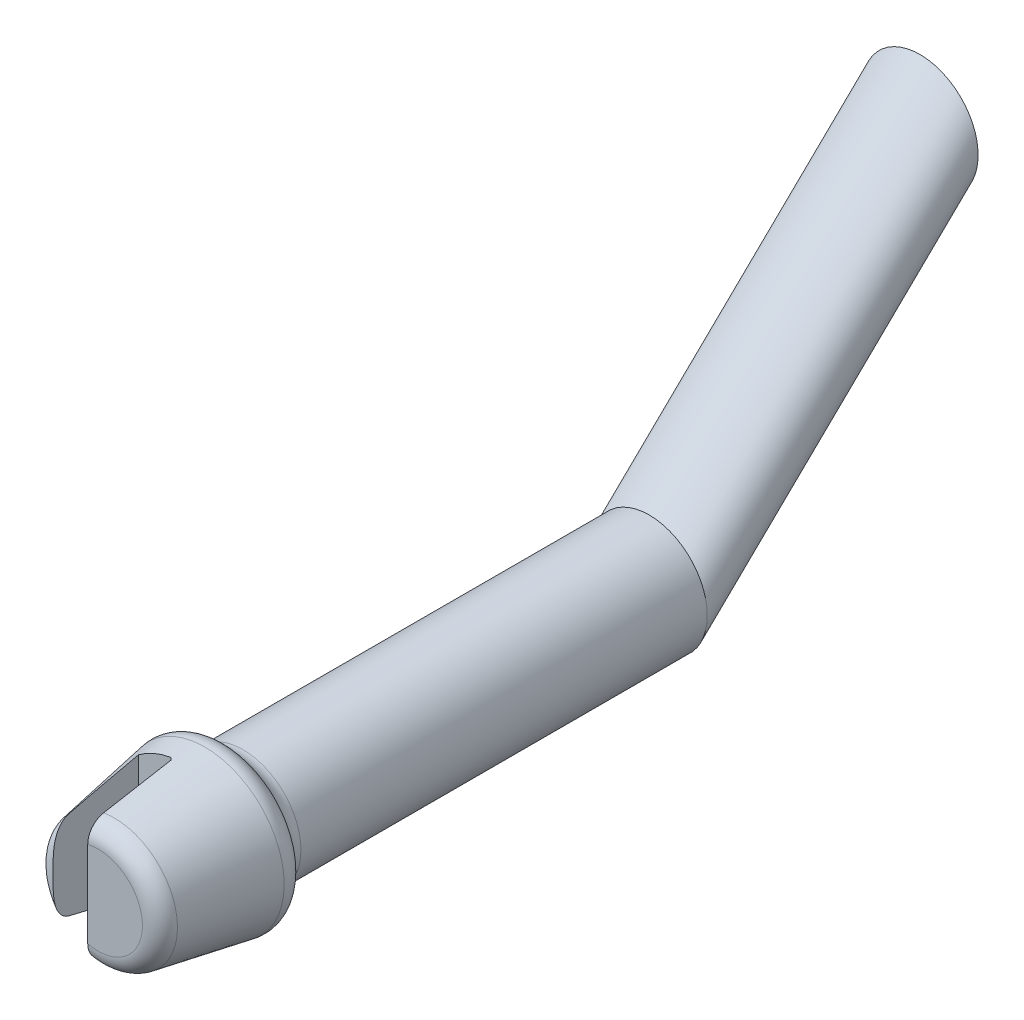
ISO-10303-21;
HEADER;
FILE_DESCRIPTION(('STEP AP214'),'2;1');
FILE_NAME('part.step','',(''),(''),'','','');
FILE_SCHEMA(('AUTOMOTIVE_DESIGN { 1 0 10303 214 1 1 1 1 }'));
ENDSEC;
DATA;
#1=APPLICATION_CONTEXT('core data for automotive mechanical design processes');
#2=APPLICATION_PROTOCOL_DEFINITION('international standard','automotive_design',2000,#1);
#3=PRODUCT_CONTEXT('',#1,'mechanical');
#4=PRODUCT('Part','Part','',(#3));
#5=PRODUCT_RELATED_PRODUCT_CATEGORY('part','',(#4));
#6=PRODUCT_DEFINITION_FORMATION('','',#4);
#7=PRODUCT_DEFINITION_CONTEXT('part definition',#1,'design');
#8=PRODUCT_DEFINITION('design','',#6,#7);
#9=PRODUCT_DEFINITION_SHAPE('','',#8);
#10=(LENGTH_UNIT() NAMED_UNIT(*) SI_UNIT(.MILLI.,.METRE.));
#11=(NAMED_UNIT(*) PLANE_ANGLE_UNIT() SI_UNIT($,.RADIAN.));
#12=(NAMED_UNIT(*) SI_UNIT($,.STERADIAN.) SOLID_ANGLE_UNIT());
#13=UNCERTAINTY_MEASURE_WITH_UNIT(LENGTH_MEASURE(1.E-05),#10,'distance_accuracy_value','');
#14=(GEOMETRIC_REPRESENTATION_CONTEXT(3) GLOBAL_UNCERTAINTY_ASSIGNED_CONTEXT((#13)) GLOBAL_UNIT_ASSIGNED_CONTEXT((#10,
#11,#12)) REPRESENTATION_CONTEXT('',''));
#15=CARTESIAN_POINT('',(0.,0.,0.));
#16=DIRECTION('',(0.,0.,1.));
#17=DIRECTION('',(1.,0.,0.));
#18=AXIS2_PLACEMENT_3D('',#15,#16,#17);
#19=CARTESIAN_POINT('',(0.,301.943786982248,37.4));
#20=DIRECTION('',(0.,0.,1.));
#21=DIRECTION('',(1.,0.,0.));
#22=AXIS2_PLACEMENT_3D('',#19,#20,#21);
#23=TOROIDAL_SURFACE('',#22,11.4328420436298,5.);
#24=CARTESIAN_POINT('',(-11.696592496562,301.943786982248,42.3930387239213));
#25=CARTESIAN_POINT('',(-11.696592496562,301.728884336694,42.3930353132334));
#26=CARTESIAN_POINT('',(-11.696592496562,301.513981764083,42.3927352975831));
#27=CARTESIAN_POINT('',(-11.696592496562,301.084178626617,42.3914031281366));
#28=CARTESIAN_POINT('',(-11.696592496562,300.869278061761,42.3903709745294));
#29=CARTESIAN_POINT('',(-11.696592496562,300.439371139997,42.3872107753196));
#30=CARTESIAN_POINT('',(-11.696592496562,300.224364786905,42.3850821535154));
#31=CARTESIAN_POINT('',(-11.696592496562,299.794374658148,42.3791303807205));
#32=CARTESIAN_POINT('',(-11.696592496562,299.579390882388,42.375307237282));
#33=CARTESIAN_POINT('',(-11.696592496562,299.150253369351,42.365177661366));
#34=CARTESIAN_POINT('',(-11.696592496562,298.93609943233,42.3588802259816));
#35=CARTESIAN_POINT('',(-11.696592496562,298.507923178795,42.3428181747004));
#36=CARTESIAN_POINT('',(-11.696592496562,298.293900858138,42.3330536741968));
#37=CARTESIAN_POINT('',(-11.696592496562,297.866197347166,42.30891591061));
#38=CARTESIAN_POINT('',(-11.696592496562,297.652516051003,42.294544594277));
#39=CARTESIAN_POINT('',(-11.696592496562,297.225640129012,42.2599041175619));
#40=CARTESIAN_POINT('',(-11.696592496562,297.012445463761,42.2396354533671));
#41=CARTESIAN_POINT('',(-11.696592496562,296.553260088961,42.1880071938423));
#42=CARTESIAN_POINT('',(-11.696592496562,296.307404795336,42.1554018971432));
#43=CARTESIAN_POINT('',(-11.696592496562,295.817539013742,42.0779931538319));
#44=CARTESIAN_POINT('',(-11.696592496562,295.57352884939,42.0331876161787));
#45=CARTESIAN_POINT('',(-11.696592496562,295.088715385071,41.928829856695));
#46=CARTESIAN_POINT('',(-11.696592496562,294.847910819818,41.8692836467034));
#47=CARTESIAN_POINT('',(-11.696592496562,294.371353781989,41.7327780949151));
#48=CARTESIAN_POINT('',(-11.696592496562,294.135599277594,41.6558259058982));
#49=CARTESIAN_POINT('',(-11.696592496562,293.58147069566,41.4479603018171));
#50=CARTESIAN_POINT('',(-11.696592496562,293.266484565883,41.3076919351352));
#51=CARTESIAN_POINT('',(-11.696592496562,292.660995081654,40.9813427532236));
#52=CARTESIAN_POINT('',(-11.696592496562,292.370456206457,40.7953300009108));
#53=CARTESIAN_POINT('',(-11.696592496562,291.896375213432,40.4257331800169));
#54=CARTESIAN_POINT('',(-11.696592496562,291.704261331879,40.253211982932));
#55=CARTESIAN_POINT('',(-11.696592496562,291.350116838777,39.8795117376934));
#56=CARTESIAN_POINT('',(-11.696592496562,291.188051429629,39.6783663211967));
#57=CARTESIAN_POINT('',(-11.696592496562,290.926339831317,39.2847649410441));
#58=CARTESIAN_POINT('',(-11.696592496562,290.820827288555,39.09622463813));
#59=CARTESIAN_POINT('',(-11.696592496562,290.642634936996,38.704122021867));
#60=CARTESIAN_POINT('',(-11.696592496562,290.569941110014,38.5005661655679));
#61=CARTESIAN_POINT('',(-11.696592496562,290.461527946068,38.0827335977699));
#62=CARTESIAN_POINT('',(-11.696592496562,290.425979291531,37.8684120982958));
#63=CARTESIAN_POINT('',(-11.696592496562,290.3948957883,37.4368766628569));
#64=CARTESIAN_POINT('',(-11.696592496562,290.399352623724,37.2196633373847));
#65=CARTESIAN_POINT('',(-11.696592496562,290.445973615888,36.8069486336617));
#66=CARTESIAN_POINT('',(-11.696592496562,290.485108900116,36.611094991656));
#67=CARTESIAN_POINT('',(-11.696592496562,290.594693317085,36.2284509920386));
#68=CARTESIAN_POINT('',(-11.696592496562,290.66513941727,36.0416597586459));
#69=CARTESIAN_POINT('',(-11.696592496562,290.836546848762,35.6751853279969));
#70=CARTESIAN_POINT('',(-11.696592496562,290.938442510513,35.4959431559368));
#71=CARTESIAN_POINT('',(-11.696592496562,291.167222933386,35.154120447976));
#72=CARTESIAN_POINT('',(-11.696592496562,291.294128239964,34.9915537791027));
#73=CARTESIAN_POINT('',(-11.696592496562,291.530689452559,34.7265062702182));
#74=CARTESIAN_POINT('',(-11.696592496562,291.635613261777,34.6197286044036));
#75=CARTESIAN_POINT('',(-11.696592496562,291.854480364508,34.4158267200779));
#76=CARTESIAN_POINT('',(-11.696592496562,291.968426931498,34.3187060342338));
#77=CARTESIAN_POINT('',(-11.696592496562,292.32160717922,34.0416296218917));
#78=CARTESIAN_POINT('',(-11.696592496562,292.572180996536,33.8759599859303));
#79=CARTESIAN_POINT('',(-11.696592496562,293.028288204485,33.6168764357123));
#80=CARTESIAN_POINT('',(-11.696592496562,293.229601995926,33.5157297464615));
#81=CARTESIAN_POINT('',(-11.696592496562,293.640474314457,33.3314828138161));
#82=CARTESIAN_POINT('',(-11.696592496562,293.850038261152,33.2483946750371));
#83=CARTESIAN_POINT('',(-11.696592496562,294.27539646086,33.0981662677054));
#84=CARTESIAN_POINT('',(-11.696592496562,294.491206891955,33.0310725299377));
#85=CARTESIAN_POINT('',(-11.696592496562,294.926528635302,32.9110961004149));
#86=CARTESIAN_POINT('',(-11.696592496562,295.146037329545,32.8582037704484));
#87=CARTESIAN_POINT('',(-11.696592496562,295.754258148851,32.7291649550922));
#88=CARTESIAN_POINT('',(-11.696592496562,296.145624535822,32.6656006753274));
#89=CARTESIAN_POINT('',(-11.696592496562,296.931904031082,32.5654728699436));
#90=CARTESIAN_POINT('',(-11.696592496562,297.32682042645,32.5289377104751));
#91=CARTESIAN_POINT('',(-11.696592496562,297.920832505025,32.4876930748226));
#92=CARTESIAN_POINT('',(-11.696592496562,298.119506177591,32.4761952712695));
#93=CARTESIAN_POINT('',(-11.696592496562,298.517030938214,32.4568034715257));
#94=CARTESIAN_POINT('',(-11.696592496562,298.71588202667,32.4489094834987));
#95=CARTESIAN_POINT('',(-11.696592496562,299.113588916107,32.4358459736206));
#96=CARTESIAN_POINT('',(-11.696592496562,299.312444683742,32.430675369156));
#97=CARTESIAN_POINT('',(-11.696592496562,299.710194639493,32.4223053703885));
#98=CARTESIAN_POINT('',(-11.696592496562,299.909088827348,32.419105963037));
#99=CARTESIAN_POINT('',(-11.696592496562,300.308805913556,32.414044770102));
#100=CARTESIAN_POINT('',(-11.696592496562,300.509628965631,32.4121961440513));
#101=CARTESIAN_POINT('',(-11.696592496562,300.911280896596,32.4094220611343));
#102=CARTESIAN_POINT('',(-11.696592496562,301.112109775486,32.408496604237));
#103=CARTESIAN_POINT('',(-11.696592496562,301.513786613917,32.4072799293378));
#104=CARTESIAN_POINT('',(-11.696592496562,301.714634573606,32.4069887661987));
#105=CARTESIAN_POINT('',(-11.696592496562,302.116330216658,32.4069374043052));
#106=CARTESIAN_POINT('',(-11.696592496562,302.317177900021,32.4071772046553));
#107=CARTESIAN_POINT('',(-11.696592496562,302.718453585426,32.4082723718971));
#108=CARTESIAN_POINT('',(-11.696592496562,302.918881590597,32.4091264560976));
#109=CARTESIAN_POINT('',(-11.696592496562,303.319733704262,32.4117187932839));
#110=CARTESIAN_POINT('',(-11.696592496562,303.520157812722,32.4134570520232));
#111=CARTESIAN_POINT('',(-11.696592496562,303.92097620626,32.4182632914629));
#112=CARTESIAN_POINT('',(-11.696592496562,304.121370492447,32.4213311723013));
#113=CARTESIAN_POINT('',(-11.696592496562,304.522118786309,32.4294046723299));
#114=CARTESIAN_POINT('',(-11.696592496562,304.722472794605,32.4344102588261));
#115=CARTESIAN_POINT('',(-11.696592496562,305.121851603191,32.4470745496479));
#116=CARTESIAN_POINT('',(-11.696592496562,305.320876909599,32.4547165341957));
#117=CARTESIAN_POINT('',(-11.696592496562,305.718768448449,32.473529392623));
#118=CARTESIAN_POINT('',(-11.696592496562,305.917634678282,32.4847003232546));
#119=CARTESIAN_POINT('',(-11.696592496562,306.315242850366,32.51156422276));
#120=CARTESIAN_POINT('',(-11.696592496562,306.513984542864,32.5272610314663));
#121=CARTESIAN_POINT('',(-11.696592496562,306.910938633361,32.5642636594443));
#122=CARTESIAN_POINT('',(-11.696592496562,307.109151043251,32.5855693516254));
#123=CARTESIAN_POINT('',(-11.696592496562,307.698327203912,32.6591115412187));
#124=CARTESIAN_POINT('',(-11.696592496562,308.08814926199,32.7212162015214));
#125=CARTESIAN_POINT('',(-11.696592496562,308.860091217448,32.8819118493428));
#126=CARTESIAN_POINT('',(-11.696592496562,309.242222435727,32.980444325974));
#127=CARTESIAN_POINT('',(-11.696592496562,309.760293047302,33.1494537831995));
#128=CARTESIAN_POINT('',(-11.696592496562,309.902850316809,33.1998099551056));
#129=CARTESIAN_POINT('',(-11.696592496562,310.18505159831,33.30810807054));
#130=CARTESIAN_POINT('',(-11.696592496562,310.324695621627,33.3660499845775));
#131=CARTESIAN_POINT('',(-11.696592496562,310.738882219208,33.5524977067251));
#132=CARTESIAN_POINT('',(-11.696592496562,311.008021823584,33.6934188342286));
#133=CARTESIAN_POINT('',(-11.696592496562,311.526141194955,34.0143124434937));
#134=CARTESIAN_POINT('',(-11.696592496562,311.774905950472,34.194642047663));
#135=CARTESIAN_POINT('',(-11.696592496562,312.121475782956,34.4952255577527));
#136=CARTESIAN_POINT('',(-11.696592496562,312.232507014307,34.6003581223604));
#137=CARTESIAN_POINT('',(-11.696592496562,312.444088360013,34.8206232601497));
#138=CARTESIAN_POINT('',(-11.696592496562,312.544642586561,34.9357518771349));
#139=CARTESIAN_POINT('',(-11.696592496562,312.775867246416,35.2297705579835));
#140=CARTESIAN_POINT('',(-11.696592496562,312.899827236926,35.4141052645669));
#141=CARTESIAN_POINT('',(-11.696592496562,313.061780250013,35.7038055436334));
#142=CARTESIAN_POINT('',(-11.696592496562,313.111781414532,35.8026126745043));
#143=CARTESIAN_POINT('',(-11.696592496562,313.203124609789,36.0041352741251));
#144=CARTESIAN_POINT('',(-11.696592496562,313.244470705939,36.1068488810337));
#145=CARTESIAN_POINT('',(-11.696592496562,313.318108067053,36.3162217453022));
#146=CARTESIAN_POINT('',(-11.696592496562,313.350339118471,36.4229022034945));
#147=CARTESIAN_POINT('',(-11.696592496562,313.404840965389,36.6387373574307));
#148=CARTESIAN_POINT('',(-11.696592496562,313.427116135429,36.7478909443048));
#149=CARTESIAN_POINT('',(-11.696592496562,313.461327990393,36.9677992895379));
#150=CARTESIAN_POINT('',(-11.696592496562,313.473265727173,37.0785538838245));
#151=CARTESIAN_POINT('',(-11.696592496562,313.486587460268,37.3006905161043));
#152=CARTESIAN_POINT('',(-11.696592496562,313.487972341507,37.4120725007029));
#153=CARTESIAN_POINT('',(-11.696592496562,313.480536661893,37.6238190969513));
#154=CARTESIAN_POINT('',(-11.696592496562,313.472679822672,37.7242182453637));
#155=CARTESIAN_POINT('',(-11.696592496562,313.44844707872,37.9239918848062));
#156=CARTESIAN_POINT('',(-11.696592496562,313.432068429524,38.0233660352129));
#157=CARTESIAN_POINT('',(-11.696592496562,313.370472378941,38.3187848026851));
#158=CARTESIAN_POINT('',(-11.696592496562,313.312785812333,38.512363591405));
#159=CARTESIAN_POINT('',(-11.696592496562,313.167066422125,38.8884016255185));
#160=CARTESIAN_POINT('',(-11.696592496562,313.078910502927,39.070812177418));
#161=CARTESIAN_POINT('',(-11.696592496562,312.87647064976,39.4205569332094));
#162=CARTESIAN_POINT('',(-11.696592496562,312.762172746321,39.587883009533));
#163=CARTESIAN_POINT('',(-11.696592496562,312.54976966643,39.857557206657));
#164=CARTESIAN_POINT('',(-11.696592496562,312.457143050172,39.9643057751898));
#165=CARTESIAN_POINT('',(-11.696592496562,312.262834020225,40.1692540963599));
#166=CARTESIAN_POINT('',(-11.696592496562,312.161148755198,40.2674511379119));
#167=CARTESIAN_POINT('',(-11.696592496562,311.844424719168,40.5492402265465));
#168=CARTESIAN_POINT('',(-11.696592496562,311.617819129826,40.7199052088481));
#169=CARTESIAN_POINT('',(-11.696592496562,311.036555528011,41.0977259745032));
#170=CARTESIAN_POINT('',(-11.696592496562,310.670194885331,41.2866915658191));
#171=CARTESIAN_POINT('',(-11.696592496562,310.102879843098,41.5259888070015));
#172=CARTESIAN_POINT('',(-11.696592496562,309.910570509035,41.5984564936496));
#173=CARTESIAN_POINT('',(-11.696592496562,309.52154418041,41.7302552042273));
#174=CARTESIAN_POINT('',(-11.696592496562,309.324829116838,41.7895918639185));
#175=CARTESIAN_POINT('',(-11.696592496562,308.837709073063,41.9211603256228));
#176=CARTESIAN_POINT('',(-11.696592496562,308.545567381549,41.9868948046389));
#177=CARTESIAN_POINT('',(-11.696592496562,307.957447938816,42.0985054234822));
#178=CARTESIAN_POINT('',(-11.696592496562,307.661467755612,42.14436826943));
#179=CARTESIAN_POINT('',(-11.696592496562,307.066704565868,42.220654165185));
#180=CARTESIAN_POINT('',(-11.696592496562,306.767915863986,42.2510312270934));
#181=CARTESIAN_POINT('',(-11.696592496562,306.169493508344,42.3001198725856));
#182=CARTESIAN_POINT('',(-11.696592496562,305.869860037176,42.3188338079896));
#183=CARTESIAN_POINT('',(-11.696592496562,305.267906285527,42.3482086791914));
#184=CARTESIAN_POINT('',(-11.696592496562,304.965583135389,42.358806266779));
#185=CARTESIAN_POINT('',(-11.696592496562,304.360801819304,42.3746829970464));
#186=CARTESIAN_POINT('',(-11.696592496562,304.058343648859,42.3799619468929));
#187=CARTESIAN_POINT('',(-11.696592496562,303.453868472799,42.3874512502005));
#188=CARTESIAN_POINT('',(-11.696592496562,303.151851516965,42.3896663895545));
#189=CARTESIAN_POINT('',(-11.696592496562,302.547818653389,42.3924625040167));
#190=CARTESIAN_POINT('',(-11.696592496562,302.245802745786,42.3930435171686));
#191=CARTESIAN_POINT('',(-11.696592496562,301.943786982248,42.3930387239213));
#192=B_SPLINE_CURVE_WITH_KNOTS('',3,(#24,#25,#26,#27,#28,#29,#30,#31,#32,#33,#34,#35,#36,#37,
#38,#39,#40,#41,#42,#43,#44,#45,#46,#47,#48,#49,#50,#51,#52,#53,#54,#55,#56,#57,#58,#59,#60,#61,
#62,#63,#64,#65,#66,#67,#68,#69,#70,#71,#72,#73,#74,#75,#76,#77,#78,#79,#80,#81,#82,#83,#84,#85,
#86,#87,#88,#89,#90,#91,#92,#93,#94,#95,#96,#97,#98,#99,#100,#101,#102,#103,#104,#105,#106,#107,
#108,#109,#110,#111,#112,#113,#114,#115,#116,#117,#118,#119,#120,#121,#122,#123,#124,#125,#126,
#127,#128,#129,#130,#131,#132,#133,#134,#135,#136,#137,#138,#139,#140,#141,#142,#143,#144,#145,
#146,#147,#148,#149,#150,#151,#152,#153,#154,#155,#156,#157,#158,#159,#160,#161,#162,#163,#164,
#165,#166,#167,#168,#169,#170,#171,#172,#173,#174,#175,#176,#177,#178,#179,#180,#181,#182,#183,
#184,#185,#186,#187,#188,#189,#190,#191),.UNSPECIFIED.,.T.,.F.,(4,2,2,2,2,2,2,2,2,2,2,2,2,2,2,2,
2,2,2,2,2,2,2,2,2,2,2,2,2,2,2,2,2,2,2,2,2,2,2,2,2,2,2,2,2,2,2,2,2,2,2,2,2,2,2,2,2,2,2,2,2,2,2,2,
2,2,2,2,2,2,2,2,2,2,2,2,2,2,2,2,2,2,2,4),(0.,0.644707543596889,1.28941492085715,
1.93446144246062,2.57950508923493,3.22222459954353,3.8649227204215,4.50734960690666,
5.14972245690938,5.89349722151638,6.63739954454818,7.38099897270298,8.12429338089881,
9.15563679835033,10.1854548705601,10.957315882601,11.7282773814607,12.373737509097,
13.0189216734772,13.6670576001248,14.3150588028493,14.9114937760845,15.5078709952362,
16.1240219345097,16.7406811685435,17.1891933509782,17.6378690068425,18.5352221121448,
19.2102772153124,19.8857834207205,20.5632314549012,21.2402185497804,22.4282010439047,
23.6174285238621,24.2144214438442,24.8114157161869,25.4081724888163,26.0049253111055,
26.6074169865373,27.209908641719,27.812452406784,28.4149951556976,29.0162833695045,
29.6175754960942,30.2188224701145,30.8200592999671,31.4175511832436,32.0150526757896,
32.613062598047,33.2110589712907,34.3940966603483,35.5752423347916,36.0286219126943,
36.4819997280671,37.3908108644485,38.3082270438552,38.7663498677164,39.224292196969,
39.8875519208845,40.2194379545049,40.5511677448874,40.8850402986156,41.2187660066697,
41.5524577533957,41.8861215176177,42.187862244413,42.4897002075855,43.092671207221,
43.6981072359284,44.3038675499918,44.7273277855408,45.1509217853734,45.9985864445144,
47.2280719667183,47.8442984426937,48.4602599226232,49.3576860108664,50.2557115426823,
51.1563886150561,52.056884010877,52.9643381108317,53.8718251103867,54.7778929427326,
55.6839396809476),.UNSPECIFIED.);
#193=CARTESIAN_POINT('',(-11.696592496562,313.377827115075,38.2682408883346));
#194=VERTEX_POINT('',#193);
#195=CARTESIAN_POINT('',(-11.696592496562,290.509746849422,38.2682408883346));
#196=VERTEX_POINT('',#195);
#197=EDGE_CURVE('E144',#194,#196,#192,.T.);
#198=ORIENTED_EDGE('',*,*,#197,.F.);
#199=CARTESIAN_POINT('',(0.,301.943786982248,38.2682408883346));
#200=DIRECTION('',(0.,0.,-1.));
#201=DIRECTION('',(-1.,0.,0.));
#202=AXIS2_PLACEMENT_3D('',#199,#200,#201);
#203=CIRCLE('',#202,16.3568808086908);
#204=EDGE_CURVE('E180',#196,#194,#203,.T.);
#205=ORIENTED_EDGE('',*,*,#204,.F.);
#206=EDGE_LOOP('',(#198,#205));
#207=FACE_BOUND('',#206,.T.);
#208=ADVANCED_FACE('F31',(#207),#23,.T.);
#209=CARTESIAN_POINT('',(0.,301.943786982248,-100.));
#210=DIRECTION('',(0.,0.,1.));
#211=DIRECTION('',(1.,0.,0.));
#212=AXIS2_PLACEMENT_3D('',#209,#210,#211);
#213=CYLINDRICAL_SURFACE('',#212,15.);
#214=CARTESIAN_POINT('',(0.,301.943786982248,5.));
#215=DIRECTION('',(0.,0.,1.));
#216=DIRECTION('',(1.,0.,0.));
#217=AXIS2_PLACEMENT_3D('',#214,#215,#216);
#218=CIRCLE('',#217,15.);
#219=CARTESIAN_POINT('',(14.9999999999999,301.943786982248,5.));
#220=VERTEX_POINT('',#219);
#221=EDGE_CURVE('E199',#220,#220,#218,.F.);
#222=ORIENTED_EDGE('',*,*,#221,.T.);
#223=EDGE_LOOP('',(#222));
#224=FACE_BOUND('',#223,.T.);
#225=CARTESIAN_POINT('',(0.,301.943786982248,-100.));
#226=DIRECTION('',(0.,0.,-1.));
#227=DIRECTION('',(-1.,0.,0.));
#228=AXIS2_PLACEMENT_3D('',#225,#226,#227);
#229=CIRCLE('',#228,15.);
#230=CARTESIAN_POINT('',(-15.0000000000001,301.943786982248,-100.));
#231=VERTEX_POINT('',#230);
#232=EDGE_CURVE('E216',#231,#231,#229,.F.);
#233=ORIENTED_EDGE('',*,*,#232,.T.);
#234=EDGE_LOOP('',(#233));
#235=FACE_BOUND('',#234,.T.);
#236=ADVANCED_FACE('F33',(#224,#235),#213,.T.);
#237=CARTESIAN_POINT('',(0.,370.,-170.));
#238=DIRECTION('',(0.,0.,-1.));
#239=DIRECTION('',(-1.,0.,0.));
#240=AXIS2_PLACEMENT_3D('',#237,#238,#239);
#241=CIRCLE('',#240,15.);
#242=DIRECTION('',(0.,-0.697081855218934,0.716991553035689));
#243=VECTOR('',#242,1.);
#244=SURFACE_OF_LINEAR_EXTRUSION('',#241,#243);
#245=CARTESIAN_POINT('',(-15.0000000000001,370.,-170.));
#246=VERTEX_POINT('',#245);
#247=EDGE_CURVE('E203',#246,#246,#241,.T.);
#248=ORIENTED_EDGE('',*,*,#247,.F.);
#249=EDGE_LOOP('',(#248));
#250=FACE_BOUND('',#249,.T.);
#251=ORIENTED_EDGE('',*,*,#232,.F.);
#252=EDGE_LOOP('',(#251));
#253=FACE_BOUND('',#252,.T.);
#254=ADVANCED_FACE('F175',(#250,#253),#244,.F.);
#255=CARTESIAN_POINT('',(0.,370.,-170.));
#256=DIRECTION('',(0.,0.,-1.));
#257=DIRECTION('',(-1.,0.,0.));
#258=AXIS2_PLACEMENT_3D('',#255,#256,#257);
#259=PLANE('',#258);
#260=ORIENTED_EDGE('',*,*,#247,.T.);
#261=EDGE_LOOP('',(#260));
#262=FACE_BOUND('',#261,.T.);
#263=ADVANCED_FACE('F167',(#262),#259,.T.);
#264=CARTESIAN_POINT('',(0.,301.943786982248,10.));
#265=DIRECTION('',(0.,0.,-1.));
#266=DIRECTION('',(1.,0.,0.));
#267=AXIS2_PLACEMENT_3D('',#264,#265,#266);
#268=CONICAL_SURFACE('',#267,21.3413343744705,0.174532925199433);
#269=CARTESIAN_POINT('',(-12.8949081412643,321.187459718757,-0.340118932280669));
#270=CARTESIAN_POINT('',(-12.6684625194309,321.187459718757,0.374560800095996));
#271=CARTESIAN_POINT('',(-12.4383882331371,321.187459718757,1.08811036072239));
#272=CARTESIAN_POINT('',(-11.9694464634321,321.187459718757,2.51255080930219));
#273=CARTESIAN_POINT('',(-11.7305763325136,321.187459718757,3.22344082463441));
#274=CARTESIAN_POINT('',(-11.2395057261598,321.187459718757,4.65084755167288));
#275=CARTESIAN_POINT('',(-10.9871733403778,321.187459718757,5.36731908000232));
#276=CARTESIAN_POINT('',(-10.4699938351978,321.187459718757,6.79556452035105));
#277=CARTESIAN_POINT('',(-10.2051493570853,321.187459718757,7.50733938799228));
#278=CARTESIAN_POINT('',(-9.60821030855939,321.187459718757,9.06019604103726));
#279=CARTESIAN_POINT('',(-9.27291971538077,321.187459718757,9.90006409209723));
#280=CARTESIAN_POINT('',(-8.74845705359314,321.187459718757,11.1512310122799));
#281=CARTESIAN_POINT('',(-8.56997186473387,321.187459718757,11.5670137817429));
#282=CARTESIAN_POINT('',(-8.20462758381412,321.187459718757,12.3948815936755));
#283=CARTESIAN_POINT('',(-8.01776877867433,321.187459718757,12.806966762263));
#284=CARTESIAN_POINT('',(-7.63537948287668,321.187459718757,13.6239299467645));
#285=CARTESIAN_POINT('',(-7.43991140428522,321.187459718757,14.0288370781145));
#286=CARTESIAN_POINT('',(-7.03727659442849,321.187459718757,14.8327851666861));
#287=CARTESIAN_POINT('',(-6.83011081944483,321.187459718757,15.2318266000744));
#288=CARTESIAN_POINT('',(-6.40173866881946,321.187459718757,16.0216711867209));
#289=CARTESIAN_POINT('',(-6.18055067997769,321.187459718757,16.4124842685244));
#290=CARTESIAN_POINT('',(-5.72040649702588,321.187459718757,17.1834479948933));
#291=CARTESIAN_POINT('',(-5.4814577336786,321.187459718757,17.5636030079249));
#292=CARTESIAN_POINT('',(-5.13808945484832,321.187459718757,18.0743795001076));
#293=CARTESIAN_POINT('',(-5.04352451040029,321.187459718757,18.2116414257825));
#294=CARTESIAN_POINT('',(-4.85087326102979,321.187459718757,18.4836792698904));
#295=CARTESIAN_POINT('',(-4.75278676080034,321.187459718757,18.6184550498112));
#296=CARTESIAN_POINT('',(-4.4524820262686,321.187459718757,19.0187294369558));
#297=CARTESIAN_POINT('',(-4.2443964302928,321.187459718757,19.2799068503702));
#298=CARTESIAN_POINT('',(-3.81254477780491,321.187459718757,19.7815296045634));
#299=CARTESIAN_POINT('',(-3.58910075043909,321.187459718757,20.0222494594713));
#300=CARTESIAN_POINT('',(-3.11922696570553,321.187459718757,20.4798203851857));
#301=CARTESIAN_POINT('',(-2.8728439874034,321.187459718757,20.6967181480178));
#302=CARTESIAN_POINT('',(-2.42181540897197,321.187459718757,21.0407564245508));
#303=CARTESIAN_POINT('',(-2.2237148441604,321.187459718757,21.1763632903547));
#304=CARTESIAN_POINT('',(-1.81094356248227,321.187459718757,21.4204219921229));
#305=CARTESIAN_POINT('',(-1.59626732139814,321.187459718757,21.5288647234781));
#306=CARTESIAN_POINT('',(-1.14807028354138,321.187459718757,21.709807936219));
#307=CARTESIAN_POINT('',(-0.914319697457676,321.187459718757,21.7817592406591));
#308=CARTESIAN_POINT('',(-0.437097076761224,321.187459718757,21.8765842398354));
#309=CARTESIAN_POINT('',(-0.19364678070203,321.187459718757,21.8995620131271));
#310=CARTESIAN_POINT('',(0.255944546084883,321.187459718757,21.8931037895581));
#311=CARTESIAN_POINT('',(0.46222268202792,321.187459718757,21.870989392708));
#312=CARTESIAN_POINT('',(0.867735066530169,321.187459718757,21.7915907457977));
#313=CARTESIAN_POINT('',(1.06696711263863,321.187459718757,21.7342956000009));
#314=CARTESIAN_POINT('',(1.52210494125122,321.187459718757,21.5655814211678));
#315=CARTESIAN_POINT('',(1.77351764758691,321.187459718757,21.4422508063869));
#316=CARTESIAN_POINT('',(2.25574111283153,321.187459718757,21.1577257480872));
#317=CARTESIAN_POINT('',(2.48636527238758,321.187459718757,20.9962280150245));
#318=CARTESIAN_POINT('',(2.92040763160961,321.187459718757,20.6533385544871));
#319=CARTESIAN_POINT('',(3.12444626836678,321.187459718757,20.4727156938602));
#320=CARTESIAN_POINT('',(3.51665768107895,321.187459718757,20.0944995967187));
#321=CARTESIAN_POINT('',(3.70479897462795,321.187459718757,19.8968741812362));
#322=CARTESIAN_POINT('',(4.0617097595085,321.187459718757,19.496220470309));
#323=CARTESIAN_POINT('',(4.23090672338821,321.187459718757,19.2935680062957));
#324=CARTESIAN_POINT('',(4.55781608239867,321.187459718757,18.8806581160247));
#325=CARTESIAN_POINT('',(4.71557694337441,321.187459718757,18.6704392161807));
#326=CARTESIAN_POINT('',(4.86898293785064,321.187459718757,18.4572867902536));
#327=B_SPLINE_CURVE_WITH_KNOTS('',3,(#269,#270,#271,#272,#273,#274,#275,#276,#277,#278,#279,
#280,#281,#282,#283,#284,#285,#286,#287,#288,#289,#290,#291,#292,#293,#294,#295,#296,#297,#298,
#299,#300,#301,#302,#303,#304,#305,#306,#307,#308,#309,#310,#311,#312,#313,#314,#315,#316,#317,
#318,#319,#320,#321,#322,#323,#324,#325,#326),.UNSPECIFIED.,.F.,.F.,(4,2,2,2,2,2,2,2,2,2,2,2,2,
2,2,2,2,2,2,2,2,2,2,2,2,2,2,2,4),(0.,2.24910663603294,4.49889586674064,6.77761311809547,
9.05585146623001,11.7683544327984,13.1257037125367,14.4830065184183,15.8317135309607,
17.1803104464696,18.5271741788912,19.8734775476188,20.3734789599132,20.8735081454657,
21.8745308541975,22.8587422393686,23.8409887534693,24.5596190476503,25.2784898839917,
26.0078802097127,26.7357188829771,27.3547568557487,27.9739866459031,28.8093693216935,
29.6516277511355,30.4678620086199,31.2856765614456,32.0772951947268,32.8653347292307),.UNSPECIFIED.);
#328=CARTESIAN_POINT('',(-3.30351107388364,321.187459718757,20.3));
#329=VERTEX_POINT('',#328);
#330=CARTESIAN_POINT('',(-2.70405809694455,321.187459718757,20.8242514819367));
#331=VERTEX_POINT('',#330);
#332=EDGE_CURVE('E11',#329,#331,#327,.T.);
#333=ORIENTED_EDGE('',*,*,#332,.T.);
#334=CARTESIAN_POINT('',(-2.70405809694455,325.898384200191,-5.68336461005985));
#335=CARTESIAN_POINT('',(-2.70405809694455,325.436815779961,-3.08220703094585));
#336=CARTESIAN_POINT('',(-2.70405809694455,324.975087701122,-0.481077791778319));
#337=CARTESIAN_POINT('',(-2.70405809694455,324.051240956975,4.72111139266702));
#338=CARTESIAN_POINT('',(-2.70405809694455,323.589122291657,7.32217133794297));
#339=CARTESIAN_POINT('',(-2.70405809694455,322.202073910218,15.125226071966));
#340=CARTESIAN_POINT('',(-2.70405809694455,321.276451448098,20.3270977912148));
#341=CARTESIAN_POINT('',(-2.70405809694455,319.885899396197,28.1295287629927));
#342=CARTESIAN_POINT('',(-2.70405809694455,319.422028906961,30.730276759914));
#343=CARTESIAN_POINT('',(-2.70405809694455,318.493382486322,35.9316110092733));
#344=CARTESIAN_POINT('',(-2.70405809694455,318.028606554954,38.5321972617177));
#345=CARTESIAN_POINT('',(-2.70405809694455,317.097899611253,43.7331641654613));
#346=CARTESIAN_POINT('',(-2.70405809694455,316.631968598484,46.3335448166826));
#347=CARTESIAN_POINT('',(-2.70405809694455,315.698538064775,51.5340249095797));
#348=CARTESIAN_POINT('',(-2.70405809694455,315.231038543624,54.1341243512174));
#349=CARTESIAN_POINT('',(-2.70405809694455,314.762548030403,56.7340455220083));
#350=B_SPLINE_CURVE_WITH_KNOTS('',3,(#334,#335,#336,#337,#338,#339,#340,#341,#342,#343,#344,
#345,#346,#347,#348,#349),.UNSPECIFIED.,.F.,.F.,(4,2,2,2,2,2,2,4),(0.,7.92537664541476,
15.8507535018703,31.7015010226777,39.6268774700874,47.5522536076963,55.4776327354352,
63.4030129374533),.UNSPECIFIED.);
#351=CARTESIAN_POINT('',(-2.70405809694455,318.075607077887,38.2682408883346));
#352=VERTEX_POINT('',#351);
#353=EDGE_CURVE('E103',#331,#352,#350,.T.);
#354=ORIENTED_EDGE('',*,*,#353,.T.);
#355=CARTESIAN_POINT('',(-2.70405809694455,285.811966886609,38.2682408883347));
#356=VERTEX_POINT('',#355);
#357=EDGE_CURVE('E187',#352,#356,#203,.T.);
#358=ORIENTED_EDGE('',*,*,#357,.T.);
#359=CARTESIAN_POINT('',(-2.70405809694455,289.101358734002,56.6027072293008));
#360=CARTESIAN_POINT('',(-2.70405809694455,288.770861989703,54.7685367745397));
#361=CARTESIAN_POINT('',(-2.70405809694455,288.440872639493,52.9342749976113));
#362=CARTESIAN_POINT('',(-2.70405809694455,287.781738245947,49.2655998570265));
#363=CARTESIAN_POINT('',(-2.70405809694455,287.452593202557,47.4311864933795));
#364=CARTESIAN_POINT('',(-2.70405809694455,286.466168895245,41.9277660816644));
#365=CARTESIAN_POINT('',(-2.70405809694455,285.809900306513,38.2585778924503));
#366=CARTESIAN_POINT('',(-2.70405809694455,284.879315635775,33.0480977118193));
#367=CARTESIAN_POINT('',(-2.70405809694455,284.604236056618,31.506941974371));
#368=CARTESIAN_POINT('',(-2.70405809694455,284.05436534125,28.4245789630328));
#369=CARTESIAN_POINT('',(-2.70405809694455,283.779574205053,26.8833716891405));
#370=CARTESIAN_POINT('',(-2.70405809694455,282.576266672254,20.1313161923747));
#371=CARTESIAN_POINT('',(-2.70405809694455,281.64903596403,14.920238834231));
#372=CARTESIAN_POINT('',(-2.70405809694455,280.259573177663,7.10337746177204));
#373=CARTESIAN_POINT('',(-2.70405809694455,279.796649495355,4.49771630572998));
#374=CARTESIAN_POINT('',(-2.70405809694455,278.871191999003,-0.713675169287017));
#375=CARTESIAN_POINT('',(-2.70405809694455,278.408658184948,-3.31940548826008));
#376=CARTESIAN_POINT('',(-2.70405809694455,277.946283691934,-5.92516408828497));
#377=B_SPLINE_CURVE_WITH_KNOTS('',3,(#359,#360,#361,#362,#363,#364,#365,#366,#367,#368,#369,
#370,#371,#372,#373,#374,#375,#376),.UNSPECIFIED.,.F.,.F.,(4,2,2,2,2,2,2,2,4),(0.,
5.59112525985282,11.1822501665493,22.3644974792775,27.061035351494,31.7575734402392,
47.6363559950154,55.5757461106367,63.5151360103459),.UNSPECIFIED.);
#378=CARTESIAN_POINT('',(-2.70405809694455,282.606770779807,20.3));
#379=VERTEX_POINT('',#378);
#380=EDGE_CURVE('E114',#356,#379,#377,.T.);
#381=ORIENTED_EDGE('',*,*,#380,.T.);
#382=CARTESIAN_POINT('',(0.,301.943786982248,20.3));
#383=DIRECTION('',(0.,0.,1.));
#384=DIRECTION('',(1.,0.,0.));
#385=AXIS2_PLACEMENT_3D('',#382,#383,#384);
#386=CIRCLE('',#385,19.5251664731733);
#387=CARTESIAN_POINT('',(-11.696592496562,286.309790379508,20.3));
#388=VERTEX_POINT('',#387);
#389=EDGE_CURVE('E96',#388,#379,#386,.T.);
#390=ORIENTED_EDGE('',*,*,#389,.F.);
#391=CARTESIAN_POINT('',(-11.696592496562,280.671010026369,-6.64531782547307));
#392=CARTESIAN_POINT('',(-11.696592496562,280.933933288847,-5.3387349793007));
#393=CARTESIAN_POINT('',(-11.696592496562,281.197928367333,-4.03236720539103));
#394=CARTESIAN_POINT('',(-11.696592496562,281.728356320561,-1.42012516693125));
#395=CARTESIAN_POINT('',(-11.696592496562,281.994789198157,-0.11425090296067));
#396=CARTESIAN_POINT('',(-11.696592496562,282.530363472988,2.49682640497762));
#397=CARTESIAN_POINT('',(-11.696592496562,282.799504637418,3.80202949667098));
#398=CARTESIAN_POINT('',(-11.696592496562,283.340880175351,6.4117943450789));
#399=CARTESIAN_POINT('',(-11.696592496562,283.6131145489,7.71635610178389));
#400=CARTESIAN_POINT('',(-11.696592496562,284.160895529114,10.3237352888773));
#401=CARTESIAN_POINT('',(-11.696592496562,284.436439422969,11.6265532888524));
#402=CARTESIAN_POINT('',(-11.696592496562,284.991565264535,14.2313285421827));
#403=CARTESIAN_POINT('',(-11.696592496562,285.271147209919,15.5332857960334));
#404=CARTESIAN_POINT('',(-11.696592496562,285.835014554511,18.1363170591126));
#405=CARTESIAN_POINT('',(-11.696592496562,286.119300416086,19.4373909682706));
#406=CARTESIAN_POINT('',(-11.696592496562,286.693340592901,22.0383305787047));
#407=CARTESIAN_POINT('',(-11.696592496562,286.983094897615,23.3381962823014));
#408=CARTESIAN_POINT('',(-11.696592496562,287.56940096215,25.9379181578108));
#409=CARTESIAN_POINT('',(-11.696592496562,287.865959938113,27.2377727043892));
#410=CARTESIAN_POINT('',(-11.696592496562,288.466854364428,29.8356699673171));
#411=CARTESIAN_POINT('',(-11.696592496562,288.771189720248,31.1337127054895));
#412=CARTESIAN_POINT('',(-11.696592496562,289.389281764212,33.7272343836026));
#413=CARTESIAN_POINT('',(-11.696592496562,289.703036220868,35.022713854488));
#414=CARTESIAN_POINT('',(-11.696592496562,290.342359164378,37.6108305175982));
#415=CARTESIAN_POINT('',(-11.696592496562,290.667928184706,38.9034675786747));
#416=CARTESIAN_POINT('',(-11.696592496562,291.167784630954,40.8401230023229));
#417=CARTESIAN_POINT('',(-11.696592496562,291.336405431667,41.4856048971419));
#418=CARTESIAN_POINT('',(-11.696592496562,291.67800230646,42.7754145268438));
#419=CARTESIAN_POINT('',(-11.696592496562,291.850978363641,43.4197422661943));
#420=CARTESIAN_POINT('',(-11.696592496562,292.201938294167,44.7069481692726));
#421=CARTESIAN_POINT('',(-11.696592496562,292.379921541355,45.3498265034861));
#422=CARTESIAN_POINT('',(-11.696592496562,292.74177080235,46.6339395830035));
#423=CARTESIAN_POINT('',(-11.696592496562,292.92563690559,47.2751743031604));
#424=CARTESIAN_POINT('',(-11.696592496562,293.300489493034,48.5561241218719));
#425=CARTESIAN_POINT('',(-11.696592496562,293.491481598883,49.1958375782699));
#426=CARTESIAN_POINT('',(-11.696592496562,293.88186188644,50.4726798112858));
#427=CARTESIAN_POINT('',(-11.696592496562,294.081249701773,51.1098086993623));
#428=CARTESIAN_POINT('',(-11.696592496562,294.388137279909,52.0631369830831));
#429=CARTESIAN_POINT('',(-11.696592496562,294.491757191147,52.3805867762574));
#430=CARTESIAN_POINT('',(-11.696592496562,294.701906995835,53.01451953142));
#431=CARTESIAN_POINT('',(-11.696592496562,294.808436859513,53.3310025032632));
#432=CARTESIAN_POINT('',(-11.696592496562,295.02478590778,53.9628956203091));
#433=CARTESIAN_POINT('',(-11.696592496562,295.134605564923,54.2783056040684));
#434=CARTESIAN_POINT('',(-11.696592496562,295.357994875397,54.9078063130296));
#435=CARTESIAN_POINT('',(-11.696592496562,295.471564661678,55.2218969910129));
#436=CARTESIAN_POINT('',(-11.696592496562,295.587243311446,55.5352165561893));
#437=B_SPLINE_CURVE_WITH_KNOTS('',3,(#391,#392,#393,#394,#395,#396,#397,#398,#399,#400,#401,
#402,#403,#404,#405,#406,#407,#408,#409,#410,#411,#412,#413,#414,#415,#416,#417,#418,#419,#420,
#421,#422,#423,#424,#425,#426,#427,#428,#429,#430,#431,#432,#433,#434,#435,#436),.UNSPECIFIED.,
.F.,.F.,(4,2,2,2,2,2,2,2,2,2,2,2,2,2,2,2,2,2,2,2,2,2,4),(0.,3.99832338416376,7.99665144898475,
11.9946387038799,15.9926260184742,19.987533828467,23.9824393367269,27.9777398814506,
31.9730327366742,35.9727785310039,39.9724757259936,43.9712327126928,47.9701704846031,
49.9715875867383,51.972996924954,53.9741570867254,55.9753476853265,57.9781518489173,
59.9808687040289,60.9826572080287,61.9844354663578,62.9863583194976,63.9883167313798),.UNSPECIFIED.);
#438=EDGE_CURVE('E186',#388,#196,#437,.T.);
#439=ORIENTED_EDGE('',*,*,#438,.T.);
#440=ORIENTED_EDGE('',*,*,#204,.T.);
#441=CARTESIAN_POINT('',(-11.696592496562,308.242808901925,55.6904410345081));
#442=CARTESIAN_POINT('',(-11.696592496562,308.407918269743,55.2462280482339));
#443=CARTESIAN_POINT('',(-11.696592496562,308.568745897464,54.8004510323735));
#444=CARTESIAN_POINT('',(-11.696592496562,308.883078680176,53.9063591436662));
#445=CARTESIAN_POINT('',(-11.696592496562,309.036584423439,53.4580444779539));
#446=CARTESIAN_POINT('',(-11.696592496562,309.337500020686,52.5595170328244));
#447=CARTESIAN_POINT('',(-11.696592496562,309.484911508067,52.1093047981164));
#448=CARTESIAN_POINT('',(-11.696592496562,309.774560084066,51.2072105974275));
#449=CARTESIAN_POINT('',(-11.696592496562,309.916797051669,50.755328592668));
#450=CARTESIAN_POINT('',(-11.696592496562,310.336682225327,49.398189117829));
#451=CARTESIAN_POINT('',(-11.696592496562,310.607690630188,48.4908764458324));
#452=CARTESIAN_POINT('',(-11.696592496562,311.136176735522,46.6722676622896));
#453=CARTESIAN_POINT('',(-11.696592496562,311.393653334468,45.7609712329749));
#454=CARTESIAN_POINT('',(-11.696592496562,311.897608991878,43.936291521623));
#455=CARTESIAN_POINT('',(-11.696592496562,312.144098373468,43.0229110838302));
#456=CARTESIAN_POINT('',(-11.696592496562,312.6283548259,41.1938755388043));
#457=CARTESIAN_POINT('',(-11.696592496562,312.866122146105,40.2782204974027));
#458=CARTESIAN_POINT('',(-11.696592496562,313.334473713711,38.444930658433));
#459=CARTESIAN_POINT('',(-11.696592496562,313.565056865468,37.5272955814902));
#460=CARTESIAN_POINT('',(-11.696592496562,314.020149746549,35.690517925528));
#461=CARTESIAN_POINT('',(-11.696592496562,314.244659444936,34.7713753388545));
#462=CARTESIAN_POINT('',(-11.696592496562,314.646934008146,33.1041046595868));
#463=CARTESIAN_POINT('',(-11.696592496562,314.825578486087,32.3561884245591));
#464=CARTESIAN_POINT('',(-11.696592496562,315.17982633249,30.859670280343));
#465=CARTESIAN_POINT('',(-11.696592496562,315.355429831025,30.1110684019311));
#466=CARTESIAN_POINT('',(-11.696592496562,315.703966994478,28.6130931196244));
#467=CARTESIAN_POINT('',(-11.696592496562,315.876900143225,27.8637195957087));
#468=CARTESIAN_POINT('',(-11.696592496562,316.220342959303,26.3644073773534));
#469=CARTESIAN_POINT('',(-11.696592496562,316.390852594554,25.6144686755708));
#470=CARTESIAN_POINT('',(-11.696592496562,316.853208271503,23.5671576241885));
#471=CARTESIAN_POINT('',(-11.696592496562,317.142883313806,22.2692947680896));
#472=CARTESIAN_POINT('',(-11.696592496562,317.716729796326,19.6723516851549));
#473=CARTESIAN_POINT('',(-11.696592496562,318.000901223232,18.373271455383));
#474=CARTESIAN_POINT('',(-11.696592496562,318.56453983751,15.7740801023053));
#475=CARTESIAN_POINT('',(-11.696592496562,318.84400698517,14.4739689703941));
#476=CARTESIAN_POINT('',(-11.696592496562,319.398878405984,11.8728798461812));
#477=CARTESIAN_POINT('',(-11.696592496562,319.67428267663,10.5719018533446));
#478=CARTESIAN_POINT('',(-11.696592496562,320.221378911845,7.97002887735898));
#479=CARTESIAN_POINT('',(-11.696592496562,320.493073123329,6.66913436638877));
#480=CARTESIAN_POINT('',(-11.696592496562,321.033359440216,4.06670084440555));
#481=CARTESIAN_POINT('',(-11.696592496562,321.301951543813,2.76516183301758));
#482=CARTESIAN_POINT('',(-11.696592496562,321.836388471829,0.161564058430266));
#483=CARTESIAN_POINT('',(-11.696592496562,322.102233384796,-1.14049468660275));
#484=CARTESIAN_POINT('',(-11.696592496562,322.631479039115,-3.74510648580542));
#485=CARTESIAN_POINT('',(-11.696592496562,322.894879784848,-5.04765953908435));
#486=CARTESIAN_POINT('',(-11.696592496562,323.157206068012,-6.35042833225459));
#487=B_SPLINE_CURVE_WITH_KNOTS('',3,(#441,#442,#443,#444,#445,#446,#447,#448,#449,#450,#451,
#452,#453,#454,#455,#456,#457,#458,#459,#460,#461,#462,#463,#464,#465,#466,#467,#468,#469,#470,
#471,#472,#473,#474,#475,#476,#477,#478,#479,#480,#481,#482,#483,#484,#485,#486),.UNSPECIFIED.,
.F.,.F.,(4,2,2,2,2,2,2,2,2,2,2,2,2,2,2,2,2,2,2,2,2,2,4),(0.,1.42165685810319,2.84319930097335,
4.26435823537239,5.68555038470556,8.526159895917,11.3670002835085,14.2051127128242,
17.0431439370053,19.8816058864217,22.7200822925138,25.0269421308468,27.3337030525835,
29.6409044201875,31.948136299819,35.9375111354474,39.9268956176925,43.9163137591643,
47.9057343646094,51.8926209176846,55.8795097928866,59.8662697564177,63.8530225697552),.UNSPECIFIED.);
#488=CARTESIAN_POINT('',(-11.696592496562,317.577783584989,20.3));
#489=VERTEX_POINT('',#488);
#490=EDGE_CURVE('E185',#194,#489,#487,.T.);
#491=ORIENTED_EDGE('',*,*,#490,.T.);
#492=EDGE_CURVE('E45',#329,#489,#386,.T.);
#493=ORIENTED_EDGE('',*,*,#492,.F.);
#494=EDGE_LOOP('',(#333,#354,#358,#381,#390,#439,#440,#491,#493));
#495=FACE_BOUND('',#494,.T.);
#496=CARTESIAN_POINT('',(0.,301.943786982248,14.83119517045));
#497=DIRECTION('',(0.,0.,1.));
#498=DIRECTION('',(1.,0.,0.));
#499=AXIS2_PLACEMENT_3D('',#496,#497,#498);
#500=CIRCLE('',#499,20.4894643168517);
#501=CARTESIAN_POINT('',(20.4894643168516,301.943786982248,14.83119517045));
#502=VERTEX_POINT('',#501);
#503=EDGE_CURVE('E196',#502,#502,#500,.T.);
#504=ORIENTED_EDGE('',*,*,#503,.T.);
#505=EDGE_LOOP('',(#504));
#506=FACE_BOUND('',#505,.T.);
#507=ADVANCED_FACE('F119',(#495,#506),#268,.T.);
#508=CARTESIAN_POINT('',(0.,301.943786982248,42.4));
#509=DIRECTION('',(0.,0.,1.));
#510=DIRECTION('',(1.,0.,0.));
#511=AXIS2_PLACEMENT_3D('',#508,#509,#510);
#512=PLANE('',#511);
#513=DIRECTION('',(0.,1.,0.));
#514=VECTOR('',#513,1.);
#515=CARTESIAN_POINT('',(-2.70405809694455,321.187459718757,42.4));
#516=LINE('',#515,#514);
#517=CARTESIAN_POINT('',(-2.70405809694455,290.835324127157,42.4));
#518=VERTEX_POINT('',#517);
#519=CARTESIAN_POINT('',(-2.70405809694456,313.052249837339,42.4));
#520=VERTEX_POINT('',#519);
#521=EDGE_CURVE('E52',#518,#520,#516,.T.);
#522=ORIENTED_EDGE('',*,*,#521,.F.);
#523=CARTESIAN_POINT('',(0.,301.943786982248,42.4));
#524=DIRECTION('',(0.,0.,1.));
#525=DIRECTION('',(1.,0.,0.));
#526=AXIS2_PLACEMENT_3D('',#523,#524,#525);
#527=CIRCLE('',#526,11.4328420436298);
#528=EDGE_CURVE('E188',#518,#520,#527,.T.);
#529=ORIENTED_EDGE('',*,*,#528,.T.);
#530=EDGE_LOOP('',(#522,#529));
#531=FACE_BOUND('',#530,.T.);
#532=ADVANCED_FACE('F160',(#531),#512,.T.);
#533=CARTESIAN_POINT('',(0.,301.943786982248,5.));
#534=DIRECTION('',(0.,0.,1.));
#535=DIRECTION('',(1.,0.,0.));
#536=AXIS2_PLACEMENT_3D('',#533,#534,#535);
#537=TOROIDAL_SURFACE('',#536,20.,5.);
#538=CARTESIAN_POINT('',(0.,301.943786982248,9.48147714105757));
#539=DIRECTION('',(0.,0.,-1.));
#540=DIRECTION('',(-1.,0.,0.));
#541=AXIS2_PLACEMENT_3D('',#538,#539,#540);
#542=CIRCLE('',#541,17.7827127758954);
#543=CARTESIAN_POINT('',(-17.7827127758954,301.943786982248,9.48147714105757));
#544=VERTEX_POINT('',#543);
#545=EDGE_CURVE('E191',#544,#544,#542,.T.);
#546=ORIENTED_EDGE('',*,*,#545,.T.);
#547=EDGE_LOOP('',(#546));
#548=FACE_BOUND('',#547,.T.);
#549=ORIENTED_EDGE('',*,*,#221,.F.);
#550=EDGE_LOOP('',(#549));
#551=FACE_BOUND('',#550,.T.);
#552=ADVANCED_FACE('F157',(#548,#551),#537,.F.);
#553=CARTESIAN_POINT('',(0.,301.943786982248,13.9629542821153));
#554=DIRECTION('',(0.,0.,-1.));
#555=DIRECTION('',(-1.,0.,0.));
#556=AXIS2_PLACEMENT_3D('',#553,#554,#555);
#557=TOROIDAL_SURFACE('',#556,15.5654255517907,5.);
#558=ORIENTED_EDGE('',*,*,#545,.F.);
#559=EDGE_LOOP('',(#558));
#560=FACE_BOUND('',#559,.T.);
#561=ORIENTED_EDGE('',*,*,#503,.F.);
#562=EDGE_LOOP('',(#561));
#563=FACE_BOUND('',#562,.T.);
#564=ADVANCED_FACE('F151',(#560,#563),#557,.T.);
#565=CARTESIAN_POINT('',(-2.70405809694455,287.114490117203,40.8268494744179));
#566=CARTESIAN_POINT('',(-2.70405809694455,287.213289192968,40.9301199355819));
#567=CARTESIAN_POINT('',(-2.70405809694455,287.316498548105,41.029157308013));
#568=CARTESIAN_POINT('',(-2.70405809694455,287.53100115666,41.2181297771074));
#569=CARTESIAN_POINT('',(-2.70405809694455,287.642296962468,41.3080619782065));
#570=CARTESIAN_POINT('',(-2.70405809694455,287.872225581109,41.478268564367));
#571=CARTESIAN_POINT('',(-2.70405809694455,287.990866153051,41.5585324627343));
#572=CARTESIAN_POINT('',(-2.70405809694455,288.234539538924,41.7087941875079));
#573=CARTESIAN_POINT('',(-2.70405809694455,288.359574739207,41.7787881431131));
#574=CARTESIAN_POINT('',(-2.70405809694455,288.614851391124,41.907919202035));
#575=CARTESIAN_POINT('',(-2.70405809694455,288.745083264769,41.9670752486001));
#576=CARTESIAN_POINT('',(-2.70405809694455,289.010069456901,42.0743510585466));
#577=CARTESIAN_POINT('',(-2.70405809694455,289.144825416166,42.1224667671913));
#578=CARTESIAN_POINT('',(-2.70405809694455,289.417769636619,42.2073416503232));
#579=CARTESIAN_POINT('',(-2.70405809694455,289.555955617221,42.244108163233));
#580=CARTESIAN_POINT('',(-2.70405809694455,289.834933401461,42.3061599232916));
#581=CARTESIAN_POINT('',(-2.70405809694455,289.975726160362,42.3314408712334));
#582=CARTESIAN_POINT('',(-2.70405809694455,290.261195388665,42.3707211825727));
#583=CARTESIAN_POINT('',(-2.70405809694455,290.40589785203,42.384531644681));
#584=CARTESIAN_POINT('',(-2.70405809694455,290.695999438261,42.4001661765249));
#585=CARTESIAN_POINT('',(-2.70405809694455,290.841398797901,42.4019858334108));
#586=CARTESIAN_POINT('',(-2.70405809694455,291.131823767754,42.3936950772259));
#587=CARTESIAN_POINT('',(-2.70405809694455,291.27684945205,42.3835872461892));
#588=CARTESIAN_POINT('',(-2.70405809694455,291.56564592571,42.3515833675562));
#589=CARTESIAN_POINT('',(-2.70405809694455,291.709416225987,42.3296829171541));
#590=CARTESIAN_POINT('',(-2.70405809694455,291.998372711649,42.2735912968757));
#591=CARTESIAN_POINT('',(-2.70405809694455,292.143500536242,42.2390991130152));
#592=CARTESIAN_POINT('',(-2.70405809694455,292.430455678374,42.1582200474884));
#593=CARTESIAN_POINT('',(-2.70405809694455,292.572281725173,42.1118286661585));
#594=CARTESIAN_POINT('',(-2.70405809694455,292.851610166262,42.007517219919));
#595=CARTESIAN_POINT('',(-2.70405809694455,292.989113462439,41.9495995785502));
#596=CARTESIAN_POINT('',(-2.70405809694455,293.258894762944,41.8226696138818));
#597=CARTESIAN_POINT('',(-2.70405809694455,293.391170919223,41.7536534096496));
#598=CARTESIAN_POINT('',(-2.70405809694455,293.784207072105,41.5274567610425));
#599=CARTESIAN_POINT('',(-2.70405809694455,294.035546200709,41.3532236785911));
#600=CARTESIAN_POINT('',(-2.70405809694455,294.387456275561,41.0622074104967));
#601=CARTESIAN_POINT('',(-2.70405809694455,294.500642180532,40.9601812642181));
#602=CARTESIAN_POINT('',(-2.70405809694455,294.717847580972,40.7467971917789));
#603=CARTESIAN_POINT('',(-2.70405809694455,294.821870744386,40.6354430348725));
#604=CARTESIAN_POINT('',(-2.70405809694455,295.019081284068,40.4049498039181));
#605=CARTESIAN_POINT('',(-2.70405809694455,295.112342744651,40.2858740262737));
#606=CARTESIAN_POINT('',(-2.70405809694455,295.287967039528,40.0400075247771));
#607=CARTESIAN_POINT('',(-2.70405809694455,295.370334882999,39.9132203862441));
#608=CARTESIAN_POINT('',(-2.70405809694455,295.523302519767,39.6527193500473));
#609=CARTESIAN_POINT('',(-2.70405809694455,295.593901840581,39.5190051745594));
#610=CARTESIAN_POINT('',(-2.70405809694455,295.722396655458,39.2456769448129));
#611=CARTESIAN_POINT('',(-2.70405809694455,295.780298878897,39.106066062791));
#612=CARTESIAN_POINT('',(-2.70405809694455,295.87934671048,38.8310254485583));
#613=CARTESIAN_POINT('',(-2.70405809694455,295.921324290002,38.6958951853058));
#614=CARTESIAN_POINT('',(-2.70405809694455,295.99283231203,38.4224403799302));
#615=CARTESIAN_POINT('',(-2.70405809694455,296.022368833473,38.2841174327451));
#616=CARTESIAN_POINT('',(-2.70405809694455,296.068554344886,38.005386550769));
#617=CARTESIAN_POINT('',(-2.70405809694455,296.085208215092,37.8649794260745));
#618=CARTESIAN_POINT('',(-2.70405809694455,296.10537055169,37.5832267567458));
#619=CARTESIAN_POINT('',(-2.70405809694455,296.108879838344,37.4418812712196));
#620=CARTESIAN_POINT('',(-2.70405809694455,296.102950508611,37.1710043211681));
#621=CARTESIAN_POINT('',(-2.70405809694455,296.094544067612,37.0414490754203));
#622=CARTESIAN_POINT('',(-2.70405809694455,296.066712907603,36.7834840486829));
#623=CARTESIAN_POINT('',(-2.70405809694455,296.047284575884,36.6550746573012));
#624=CARTESIAN_POINT('',(-2.70405809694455,295.997679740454,36.4003940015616));
#625=CARTESIAN_POINT('',(-2.70405809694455,295.96750646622,36.2741221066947));
#626=CARTESIAN_POINT('',(-2.70405809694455,295.89678628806,36.0244723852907));
#627=CARTESIAN_POINT('',(-2.70405809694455,295.856235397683,35.9010956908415));
#628=CARTESIAN_POINT('',(-2.70405809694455,295.765244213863,35.6580626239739));
#629=CARTESIAN_POINT('',(-2.70405809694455,295.714805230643,35.5384057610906));
#630=CARTESIAN_POINT('',(-2.70405809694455,295.604571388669,35.3034658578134));
#631=CARTESIAN_POINT('',(-2.70405809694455,295.544773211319,35.188184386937));
#632=CARTESIAN_POINT('',(-2.70405809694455,295.352192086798,34.8498947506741));
#633=CARTESIAN_POINT('',(-2.70405809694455,295.206158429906,34.6342723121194));
#634=CARTESIAN_POINT('',(-2.70405809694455,294.871024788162,34.2114908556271));
#635=CARTESIAN_POINT('',(-2.70405809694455,294.679454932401,34.0063021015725));
#636=CARTESIAN_POINT('',(-2.70405809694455,294.266575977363,33.6283527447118));
#637=CARTESIAN_POINT('',(-2.70405809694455,294.045257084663,33.4556028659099));
#638=CARTESIAN_POINT('',(-2.70405809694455,293.562449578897,33.1355998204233));
#639=CARTESIAN_POINT('',(-2.70405809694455,293.299241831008,32.9909341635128));
#640=CARTESIAN_POINT('',(-2.70405809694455,292.752592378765,32.7468598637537));
#641=CARTESIAN_POINT('',(-2.70405809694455,292.469147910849,32.6474574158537));
#642=CARTESIAN_POINT('',(-2.70405809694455,291.88415910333,32.4955431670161));
#643=CARTESIAN_POINT('',(-2.70405809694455,291.582373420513,32.4439565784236));
#644=CARTESIAN_POINT('',(-2.70405809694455,290.974404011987,32.3930911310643));
#645=CARTESIAN_POINT('',(-2.70405809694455,290.668220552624,32.393809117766));
#646=CARTESIAN_POINT('',(-2.70405809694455,290.065604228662,32.447797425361));
#647=CARTESIAN_POINT('',(-2.70405809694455,289.769093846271,32.5001991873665));
#648=CARTESIAN_POINT('',(-2.70405809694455,289.189554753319,32.6554282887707));
#649=CARTESIAN_POINT('',(-2.70405809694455,288.906524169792,32.7582486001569));
#650=CARTESIAN_POINT('',(-2.70405809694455,288.37002484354,33.0083814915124));
#651=CARTESIAN_POINT('',(-2.70405809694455,288.11597159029,33.1544432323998));
#652=CARTESIAN_POINT('',(-2.70405809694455,287.636676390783,33.4882389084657));
#653=CARTESIAN_POINT('',(-2.70405809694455,287.411430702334,33.6759674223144));
#654=CARTESIAN_POINT('',(-2.70405809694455,287.103140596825,33.9820968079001));
#655=CARTESIAN_POINT('',(-2.70405809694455,287.006250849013,34.0868998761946));
#656=CARTESIAN_POINT('',(-2.70405809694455,286.821781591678,34.304382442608));
#657=CARTESIAN_POINT('',(-2.70405809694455,286.734198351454,34.4170587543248));
#658=CARTESIAN_POINT('',(-2.70405809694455,286.568990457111,34.6495315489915));
#659=CARTESIAN_POINT('',(-2.70405809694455,286.491368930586,34.7693302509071));
#660=CARTESIAN_POINT('',(-2.70405809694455,286.346735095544,35.0151112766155));
#661=CARTESIAN_POINT('',(-2.70405809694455,286.2797186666,35.1410911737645));
#662=CARTESIAN_POINT('',(-2.70405809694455,286.157756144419,35.3963226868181));
#663=CARTESIAN_POINT('',(-2.70405809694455,286.102636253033,35.5254912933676));
#664=CARTESIAN_POINT('',(-2.70405809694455,286.003585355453,35.7879934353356));
#665=CARTESIAN_POINT('',(-2.70405809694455,285.95964999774,35.921325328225));
#666=CARTESIAN_POINT('',(-2.70405809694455,285.883265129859,36.1912812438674));
#667=CARTESIAN_POINT('',(-2.70405809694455,285.850818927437,36.3279062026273));
#668=CARTESIAN_POINT('',(-2.70405809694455,285.797688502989,36.6033713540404));
#669=CARTESIAN_POINT('',(-2.70405809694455,285.7769998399,36.7422106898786));
#670=CARTESIAN_POINT('',(-2.70405809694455,285.747653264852,37.0199261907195));
#671=CARTESIAN_POINT('',(-2.70405809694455,285.738891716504,37.1587914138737));
#672=CARTESIAN_POINT('',(-2.70405809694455,285.733130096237,37.4367135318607));
#673=CARTESIAN_POINT('',(-2.70405809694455,285.736125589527,37.5757703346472));
#674=CARTESIAN_POINT('',(-2.70405809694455,285.753851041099,37.8532197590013));
#675=CARTESIAN_POINT('',(-2.70405809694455,285.768588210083,37.9916119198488));
#676=CARTESIAN_POINT('',(-2.70405809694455,285.809687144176,38.2666070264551));
#677=CARTESIAN_POINT('',(-2.70405809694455,285.836044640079,38.4032106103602));
#678=CARTESIAN_POINT('',(-2.70405809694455,285.900139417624,38.6735170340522));
#679=CARTESIAN_POINT('',(-2.70405809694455,285.937860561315,38.8072237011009));
#680=CARTESIAN_POINT('',(-2.70405809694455,286.024397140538,39.0709425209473));
#681=CARTESIAN_POINT('',(-2.70405809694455,286.073208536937,39.2009559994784));
#682=CARTESIAN_POINT('',(-2.70405809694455,286.181518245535,39.4563053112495));
#683=CARTESIAN_POINT('',(-2.70405809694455,286.241006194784,39.5816455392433));
#684=CARTESIAN_POINT('',(-2.70405809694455,286.370237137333,39.8268699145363));
#685=CARTESIAN_POINT('',(-2.70405809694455,286.439977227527,39.9467555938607));
#686=CARTESIAN_POINT('',(-2.70405809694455,286.601866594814,40.2000824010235));
#687=CARTESIAN_POINT('',(-2.70405809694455,286.695810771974,40.332381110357));
#688=CARTESIAN_POINT('',(-2.70405809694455,286.896110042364,40.5872170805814));
#689=CARTESIAN_POINT('',(-2.70405809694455,287.002465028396,40.7097544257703));
#690=CARTESIAN_POINT('',(-2.70405809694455,287.114490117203,40.8268494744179));
#691=B_SPLINE_CURVE_WITH_KNOTS('',3,(#565,#566,#567,#568,#569,#570,#571,#572,#573,#574,#575,
#576,#577,#578,#579,#580,#581,#582,#583,#584,#585,#586,#587,#588,#589,#590,#591,#592,#593,#594,
#595,#596,#597,#598,#599,#600,#601,#602,#603,#604,#605,#606,#607,#608,#609,#610,#611,#612,#613,
#614,#615,#616,#617,#618,#619,#620,#621,#622,#623,#624,#625,#626,#627,#628,#629,#630,#631,#632,
#633,#634,#635,#636,#637,#638,#639,#640,#641,#642,#643,#644,#645,#646,#647,#648,#649,#650,#651,
#652,#653,#654,#655,#656,#657,#658,#659,#660,#661,#662,#663,#664,#665,#666,#667,#668,#669,#670,
#671,#672,#673,#674,#675,#676,#677,#678,#679,#680,#681,#682,#683,#684,#685,#686,#687,#688,#689,
#690),.UNSPECIFIED.,.T.,.F.,(4,2,2,2,2,2,2,2,2,2,2,2,2,2,2,2,2,2,2,2,2,2,2,2,2,2,2,2,2,2,2,2,2,
2,2,2,2,2,2,2,2,2,2,2,2,2,2,2,2,2,2,2,2,2,2,2,2,2,2,2,2,2,4),(0.,0.428612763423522,
0.857361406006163,1.28657098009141,1.71594191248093,2.14455504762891,2.5733253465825,
3.00181781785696,3.43047054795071,3.86604991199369,4.30178956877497,4.73743491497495,
5.17324302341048,5.62023608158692,6.06739841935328,6.51446683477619,6.96169192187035,
7.8739523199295,8.3306789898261,8.78722198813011,9.24040640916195,9.69338171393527,
10.1463752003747,10.599128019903,11.0230634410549,11.4467914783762,11.8703589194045,
12.293899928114,12.6829144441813,13.0720565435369,13.4610817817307,13.8502566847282,
14.2393800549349,14.6286417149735,15.4066286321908,16.2452665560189,17.0841812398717,
17.9810791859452,18.8780998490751,19.7921356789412,20.7061163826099,21.6049946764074,
22.5037477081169,23.3786911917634,24.253520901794,24.6812814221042,25.1088698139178,
25.5365921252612,25.9641478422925,26.3849560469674,26.8056002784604,27.2263655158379,
27.6469717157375,28.0638993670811,28.4806697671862,28.8976963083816,29.3145697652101,
29.7308539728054,30.1469868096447,30.5627178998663,30.9783314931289,31.464325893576,
31.9503160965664),.UNSPECIFIED.);
#692=EDGE_CURVE('E140',#356,#518,#691,.T.);
#693=ORIENTED_EDGE('',*,*,#692,.F.);
#694=ORIENTED_EDGE('',*,*,#357,.F.);
#695=CARTESIAN_POINT('',(-2.70405809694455,308.574313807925,39.9978677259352));
#696=CARTESIAN_POINT('',(-2.70405809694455,308.65616582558,40.1225030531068));
#697=CARTESIAN_POINT('',(-2.70405809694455,308.743512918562,40.2435423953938));
#698=CARTESIAN_POINT('',(-2.70405809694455,308.928306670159,40.4776755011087));
#699=CARTESIAN_POINT('',(-2.70405809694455,309.025758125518,40.5907654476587));
#700=CARTESIAN_POINT('',(-2.70405809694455,309.332320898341,40.917401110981));
#701=CARTESIAN_POINT('',(-2.70405809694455,309.555473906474,41.1180609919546));
#702=CARTESIAN_POINT('',(-2.70405809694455,310.031181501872,41.4792058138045));
#703=CARTESIAN_POINT('',(-2.70405809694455,310.28366969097,41.6397789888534));
#704=CARTESIAN_POINT('',(-2.70405809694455,310.811435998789,41.917356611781));
#705=CARTESIAN_POINT('',(-2.70405809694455,311.086702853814,42.034382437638));
#706=CARTESIAN_POINT('',(-2.70405809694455,311.659307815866,42.2237518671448));
#707=CARTESIAN_POINT('',(-2.70405809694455,311.957008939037,42.2950005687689));
#708=CARTESIAN_POINT('',(-2.70405809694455,312.560250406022,42.3858789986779));
#709=CARTESIAN_POINT('',(-2.70405809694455,312.865791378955,42.4055045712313));
#710=CARTESIAN_POINT('',(-2.70405809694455,313.472087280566,42.3919232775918));
#711=CARTESIAN_POINT('',(-2.70405809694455,313.772855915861,42.3593419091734));
#712=CARTESIAN_POINT('',(-2.70405809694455,314.364268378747,42.2427579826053));
#713=CARTESIAN_POINT('',(-2.70405809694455,314.654913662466,42.1587628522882));
#714=CARTESIAN_POINT('',(-2.70405809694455,315.209735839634,41.9440915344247));
#715=CARTESIAN_POINT('',(-2.70405809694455,315.474404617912,41.814686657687));
#716=CARTESIAN_POINT('',(-2.70405809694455,315.977499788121,41.512213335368));
#717=CARTESIAN_POINT('',(-2.70405809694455,316.215929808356,41.3391509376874));
#718=CARTESIAN_POINT('',(-2.70405809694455,316.653675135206,40.9588809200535));
#719=CARTESIAN_POINT('',(-2.70405809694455,316.853799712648,40.7526045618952));
#720=CARTESIAN_POINT('',(-2.70405809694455,317.21582024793,40.3088585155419));
#721=CARTESIAN_POINT('',(-2.70405809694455,317.377720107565,40.0713920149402));
#722=CARTESIAN_POINT('',(-2.70405809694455,317.655784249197,39.576544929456));
#723=CARTESIAN_POINT('',(-2.70405809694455,317.772702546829,39.3195878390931));
#724=CARTESIAN_POINT('',(-2.70405809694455,317.961226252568,38.7895571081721));
#725=CARTESIAN_POINT('',(-2.70405809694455,318.032834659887,38.51648453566));
#726=CARTESIAN_POINT('',(-2.70405809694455,318.128049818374,37.9650142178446));
#727=CARTESIAN_POINT('',(-2.70405809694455,318.152145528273,37.6867007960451));
#728=CARTESIAN_POINT('',(-2.70405809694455,318.153086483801,37.129998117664));
#729=CARTESIAN_POINT('',(-2.70405809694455,318.129933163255,36.8516088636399));
#730=CARTESIAN_POINT('',(-2.70405809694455,318.037243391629,36.3036881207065));
#731=CARTESIAN_POINT('',(-2.70405809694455,317.967871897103,36.0341286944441));
#732=CARTESIAN_POINT('',(-2.70405809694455,317.78498630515,35.5104338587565));
#733=CARTESIAN_POINT('',(-2.70405809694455,317.671472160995,35.2562984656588));
#734=CARTESIAN_POINT('',(-2.70405809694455,317.403268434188,34.7698026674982));
#735=CARTESIAN_POINT('',(-2.70405809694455,317.248458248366,34.53750878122));
#736=CARTESIAN_POINT('',(-2.70405809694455,316.902377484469,34.1019033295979));
#737=CARTESIAN_POINT('',(-2.70405809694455,316.711105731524,33.8985926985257));
#738=CARTESIAN_POINT('',(-2.70405809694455,316.29566396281,33.5245663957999));
#739=CARTESIAN_POINT('',(-2.70405809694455,316.071197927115,33.3541796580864));
#740=CARTESIAN_POINT('',(-2.70405809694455,315.597228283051,33.0528127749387));
#741=CARTESIAN_POINT('',(-2.70405809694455,315.347723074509,32.9218351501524));
#742=CARTESIAN_POINT('',(-2.70405809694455,314.826449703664,32.7006149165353));
#743=CARTESIAN_POINT('',(-2.70405809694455,314.554384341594,32.6110730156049));
#744=CARTESIAN_POINT('',(-2.70405809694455,313.999267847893,32.4778234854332));
#745=CARTESIAN_POINT('',(-2.70405809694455,313.716215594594,32.434120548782));
#746=CARTESIAN_POINT('',(-2.70405809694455,313.140279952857,32.3926554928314));
#747=CARTESIAN_POINT('',(-2.70405809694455,312.847319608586,32.3959643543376));
#748=CARTESIAN_POINT('',(-2.70405809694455,312.26588503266,32.4504071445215));
#749=CARTESIAN_POINT('',(-2.70405809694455,311.977411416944,32.5015475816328));
#750=CARTESIAN_POINT('',(-2.70405809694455,311.40515049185,32.6517092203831));
#751=CARTESIAN_POINT('',(-2.70405809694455,311.121681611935,32.7519443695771));
#752=CARTESIAN_POINT('',(-2.70405809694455,310.575081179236,32.9977469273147));
#753=CARTESIAN_POINT('',(-2.70405809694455,310.311953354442,33.1433226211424));
#754=CARTESIAN_POINT('',(-2.70405809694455,309.808905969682,33.4788272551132));
#755=CARTESIAN_POINT('',(-2.70405809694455,309.56947963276,33.669495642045));
#756=CARTESIAN_POINT('',(-2.70405809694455,309.12649702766,34.0891362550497));
#757=CARTESIAN_POINT('',(-2.70405809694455,308.922945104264,34.3181131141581));
#758=CARTESIAN_POINT('',(-2.70405809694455,308.652010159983,34.6834268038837));
#759=CARTESIAN_POINT('',(-2.70405809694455,308.567992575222,34.807714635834));
#760=CARTESIAN_POINT('',(-2.70405809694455,308.41136801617,35.0632637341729));
#761=CARTESIAN_POINT('',(-2.70405809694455,308.338755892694,35.1945218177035));
#762=CARTESIAN_POINT('',(-2.70405809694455,308.205846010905,35.4630635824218));
#763=CARTESIAN_POINT('',(-2.70405809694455,308.145543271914,35.6003447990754));
#764=CARTESIAN_POINT('',(-2.70405809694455,308.038047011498,35.8799515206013));
#765=CARTESIAN_POINT('',(-2.70405809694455,307.990852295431,36.0222765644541));
#766=CARTESIAN_POINT('',(-2.70405809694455,307.91329581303,36.3000891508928));
#767=CARTESIAN_POINT('',(-2.70405809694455,307.881945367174,36.4353011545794));
#768=CARTESIAN_POINT('',(-2.70405809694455,307.831572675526,36.7079995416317));
#769=CARTESIAN_POINT('',(-2.70405809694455,307.81254936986,36.8454857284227));
#770=CARTESIAN_POINT('',(-2.70405809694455,307.787129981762,37.1216029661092));
#771=CARTESIAN_POINT('',(-2.70405809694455,307.78073218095,37.2602338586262));
#772=CARTESIAN_POINT('',(-2.70405809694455,307.780663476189,37.537493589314));
#773=CARTESIAN_POINT('',(-2.70405809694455,307.786991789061,37.6761224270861));
#774=CARTESIAN_POINT('',(-2.70405809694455,307.811359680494,37.942297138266));
#775=CARTESIAN_POINT('',(-2.70405809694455,307.828525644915,38.0699240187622));
#776=CARTESIAN_POINT('',(-2.70405809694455,307.873503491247,38.3233381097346));
#777=CARTESIAN_POINT('',(-2.70405809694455,307.901319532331,38.4491245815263));
#778=CARTESIAN_POINT('',(-2.70405809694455,307.967193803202,38.6977899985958));
#779=CARTESIAN_POINT('',(-2.70405809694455,308.005237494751,38.8206728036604));
#780=CARTESIAN_POINT('',(-2.70405809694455,308.091138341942,39.0629629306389));
#781=CARTESIAN_POINT('',(-2.70405809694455,308.138996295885,39.1823699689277));
#782=CARTESIAN_POINT('',(-2.70405809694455,308.24578026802,39.4209611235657));
#783=CARTESIAN_POINT('',(-2.70405809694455,308.305024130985,39.5400029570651));
#784=CARTESIAN_POINT('',(-2.70405809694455,308.432830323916,39.7729366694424));
#785=CARTESIAN_POINT('',(-2.70405809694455,308.50139130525,39.8868292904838));
#786=CARTESIAN_POINT('',(-2.70405809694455,308.574313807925,39.9978677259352));
#787=B_SPLINE_CURVE_WITH_KNOTS('',3,(#695,#696,#697,#698,#699,#700,#701,#702,#703,#704,#705,
#706,#707,#708,#709,#710,#711,#712,#713,#714,#715,#716,#717,#718,#719,#720,#721,#722,#723,#724,
#725,#726,#727,#728,#729,#730,#731,#732,#733,#734,#735,#736,#737,#738,#739,#740,#741,#742,#743,
#744,#745,#746,#747,#748,#749,#750,#751,#752,#753,#754,#755,#756,#757,#758,#759,#760,#761,#762,
#763,#764,#765,#766,#767,#768,#769,#770,#771,#772,#773,#774,#775,#776,#777,#778,#779,#780,#781,
#782,#783,#784,#785,#786),.UNSPECIFIED.,.T.,.F.,(4,2,2,2,2,2,2,2,2,2,2,2,2,2,2,2,2,2,2,2,2,2,2,
2,2,2,2,2,2,2,2,2,2,2,2,2,2,2,2,2,2,2,2,2,2,4),(0.,0.447193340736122,0.894599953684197,
1.79030713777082,2.68402505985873,3.57730366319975,4.49122229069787,5.4052144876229,
6.30833766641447,7.21133040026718,8.09083077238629,8.97020937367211,9.82823268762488,
10.6861683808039,11.5290211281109,12.3718180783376,13.2058954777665,14.0399475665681,
14.8710386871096,15.7021306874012,16.5356769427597,17.3692500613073,18.2107634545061,
19.0523306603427,19.9076514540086,20.7630597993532,21.637985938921,22.5130311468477,
23.4108975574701,24.3089281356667,25.2228538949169,26.1368902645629,26.5864692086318,
27.0358445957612,27.4850377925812,27.9341900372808,28.3500374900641,28.765849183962,
29.1816042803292,29.5973337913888,29.9832099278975,30.3692369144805,30.7547180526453,
31.1402305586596,31.5386956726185,31.9371031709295),.UNSPECIFIED.);
#788=EDGE_CURVE('E134',#520,#352,#787,.T.);
#789=ORIENTED_EDGE('',*,*,#788,.F.);
#790=ORIENTED_EDGE('',*,*,#528,.F.);
#791=EDGE_LOOP('',(#693,#694,#789,#790));
#792=FACE_BOUND('',#791,.T.);
#793=ADVANCED_FACE('F147',(#792),#23,.T.);
#794=CARTESIAN_POINT('',(-11.696592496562,321.187459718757,20.3));
#795=DIRECTION('',(0.,1.,0.));
#796=DIRECTION('',(0.,0.,1.));
#797=AXIS2_PLACEMENT_3D('',#794,#795,#796);
#798=PLANE('',#797);
#799=DIRECTION('',(-1.,0.,0.));
#800=VECTOR('',#799,1.);
#801=CARTESIAN_POINT('',(-11.696592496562,321.187459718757,20.3));
#802=LINE('',#801,#800);
#803=CARTESIAN_POINT('',(-2.70405809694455,321.187459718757,20.3));
#804=VERTEX_POINT('',#803);
#805=EDGE_CURVE('E92',#804,#329,#802,.T.);
#806=ORIENTED_EDGE('',*,*,#805,.F.);
#807=DIRECTION('',(0.,0.,1.));
#808=VECTOR('',#807,1.);
#809=CARTESIAN_POINT('',(-2.70405809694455,321.187459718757,20.3));
#810=LINE('',#809,#808);
#811=EDGE_CURVE('E100',#804,#331,#810,.T.);
#812=ORIENTED_EDGE('',*,*,#811,.T.);
#813=ORIENTED_EDGE('',*,*,#332,.F.);
#814=EDGE_LOOP('',(#806,#812,#813));
#815=FACE_BOUND('',#814,.T.);
#816=ADVANCED_FACE('F105',(#815),#798,.F.);
#817=CARTESIAN_POINT('',(-11.696592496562,281.633537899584,20.3));
#818=DIRECTION('',(0.,0.,1.));
#819=DIRECTION('',(1.,0.,0.));
#820=AXIS2_PLACEMENT_3D('',#817,#818,#819);
#821=PLANE('',#820);
#822=ORIENTED_EDGE('',*,*,#492,.T.);
#823=DIRECTION('',(0.,-1.,0.));
#824=VECTOR('',#823,1.);
#825=CARTESIAN_POINT('',(-11.696592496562,321.187459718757,20.3));
#826=LINE('',#825,#824);
#827=EDGE_CURVE('E98',#489,#388,#826,.T.);
#828=ORIENTED_EDGE('',*,*,#827,.T.);
#829=ORIENTED_EDGE('',*,*,#389,.T.);
#830=DIRECTION('',(0.,1.,0.));
#831=VECTOR('',#830,1.);
#832=CARTESIAN_POINT('',(-2.70405809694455,321.187459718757,20.3));
#833=LINE('',#832,#831);
#834=EDGE_CURVE('E89',#379,#804,#833,.T.);
#835=ORIENTED_EDGE('',*,*,#834,.T.);
#836=ORIENTED_EDGE('',*,*,#805,.T.);
#837=EDGE_LOOP('',(#822,#828,#829,#835,#836));
#838=FACE_BOUND('',#837,.T.);
#839=ADVANCED_FACE('F91',(#838),#821,.T.);
#840=CARTESIAN_POINT('',(-11.696592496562,321.187459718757,20.3));
#841=DIRECTION('',(-1.,0.,0.));
#842=DIRECTION('',(0.,0.,1.));
#843=AXIS2_PLACEMENT_3D('',#840,#841,#842);
#844=PLANE('',#843);
#845=ORIENTED_EDGE('',*,*,#827,.F.);
#846=ORIENTED_EDGE('',*,*,#490,.F.);
#847=ORIENTED_EDGE('',*,*,#197,.T.);
#848=ORIENTED_EDGE('',*,*,#438,.F.);
#849=EDGE_LOOP('',(#845,#846,#847,#848));
#850=FACE_BOUND('',#849,.T.);
#851=ADVANCED_FACE('F126',(#850),#844,.F.);
#852=CARTESIAN_POINT('',(-2.70405809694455,321.187459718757,20.3));
#853=DIRECTION('',(1.,0.,0.));
#854=DIRECTION('',(0.,0.,-1.));
#855=AXIS2_PLACEMENT_3D('',#852,#853,#854);
#856=PLANE('',#855);
#857=ORIENTED_EDGE('',*,*,#692,.T.);
#858=ORIENTED_EDGE('',*,*,#521,.T.);
#859=ORIENTED_EDGE('',*,*,#788,.T.);
#860=ORIENTED_EDGE('',*,*,#353,.F.);
#861=ORIENTED_EDGE('',*,*,#811,.F.);
#862=ORIENTED_EDGE('',*,*,#834,.F.);
#863=ORIENTED_EDGE('',*,*,#380,.F.);
#864=EDGE_LOOP('',(#857,#858,#859,#860,#861,#862,#863));
#865=FACE_BOUND('',#864,.T.);
#866=ADVANCED_FACE('F101',(#865),#856,.F.);
#867=CLOSED_SHELL('',(#208,#236,#254,#263,#507,#532,#552,#564,#793,#816,#839,#851,#866));
#868=MANIFOLD_SOLID_BREP('B2',#867);
#869=ADVANCED_BREP_SHAPE_REPRESENTATION('',(#18,#868),#14);
#870=SHAPE_DEFINITION_REPRESENTATION(#9,#869);
ENDSEC;
END-ISO-10303-21;
